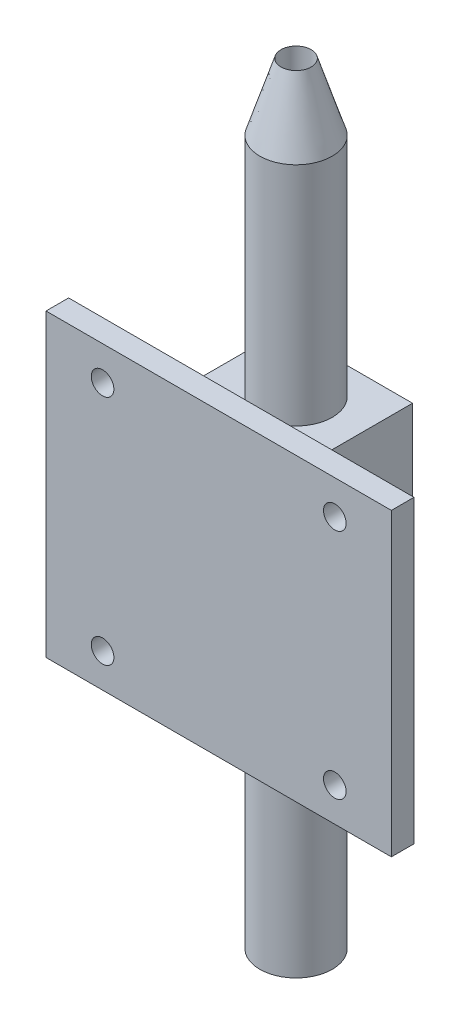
ISO-10303-21;
HEADER;
FILE_DESCRIPTION(('STEP AP214'),'2;1');
FILE_NAME('part.step','',(''),(''),'','','');
FILE_SCHEMA(('AUTOMOTIVE_DESIGN { 1 0 10303 214 1 1 1 1 }'));
ENDSEC;
DATA;
#1=APPLICATION_CONTEXT('core data for automotive mechanical design processes');
#2=APPLICATION_PROTOCOL_DEFINITION('international standard','automotive_design',2000,#1);
#3=PRODUCT_CONTEXT('',#1,'mechanical');
#4=PRODUCT('Part','Part','',(#3));
#5=PRODUCT_RELATED_PRODUCT_CATEGORY('part','',(#4));
#6=PRODUCT_DEFINITION_FORMATION('','',#4);
#7=PRODUCT_DEFINITION_CONTEXT('part definition',#1,'design');
#8=PRODUCT_DEFINITION('design','',#6,#7);
#9=PRODUCT_DEFINITION_SHAPE('','',#8);
#10=(LENGTH_UNIT() NAMED_UNIT(*) SI_UNIT(.MILLI.,.METRE.));
#11=(NAMED_UNIT(*) PLANE_ANGLE_UNIT() SI_UNIT($,.RADIAN.));
#12=(NAMED_UNIT(*) SI_UNIT($,.STERADIAN.) SOLID_ANGLE_UNIT());
#13=UNCERTAINTY_MEASURE_WITH_UNIT(LENGTH_MEASURE(1.E-05),#10,'distance_accuracy_value','');
#14=(GEOMETRIC_REPRESENTATION_CONTEXT(3) GLOBAL_UNCERTAINTY_ASSIGNED_CONTEXT((#13)) GLOBAL_UNIT_ASSIGNED_CONTEXT((#10,
#11,#12)) REPRESENTATION_CONTEXT('',''));
#15=CARTESIAN_POINT('',(0.,0.,0.));
#16=DIRECTION('',(0.,0.,1.));
#17=DIRECTION('',(1.,0.,0.));
#18=AXIS2_PLACEMENT_3D('',#15,#16,#17);
#19=CARTESIAN_POINT('',(0.,0.,0.));
#20=DIRECTION('',(0.,0.,-1.));
#21=DIRECTION('',(-1.,0.,0.));
#22=AXIS2_PLACEMENT_3D('',#19,#20,#21);
#23=PLANE('',#22);
#24=CARTESIAN_POINT('',(15.4,-15.4,0.));
#25=DIRECTION('',(0.,0.,1.));
#26=DIRECTION('',(1.,0.,0.));
#27=AXIS2_PLACEMENT_3D('',#24,#25,#26);
#28=CIRCLE('',#27,1.5);
#29=CARTESIAN_POINT('',(16.9,-15.4,0.));
#30=VERTEX_POINT('',#29);
#31=EDGE_CURVE('E139',#30,#30,#28,.T.);
#32=ORIENTED_EDGE('',*,*,#31,.T.);
#33=EDGE_LOOP('',(#32));
#34=FACE_BOUND('',#33,.T.);
#35=CARTESIAN_POINT('',(-15.4,15.4,0.));
#36=DIRECTION('',(0.,0.,1.));
#37=DIRECTION('',(1.,0.,0.));
#38=AXIS2_PLACEMENT_3D('',#35,#36,#37);
#39=CIRCLE('',#38,1.5);
#40=CARTESIAN_POINT('',(-13.9,15.4,0.));
#41=VERTEX_POINT('',#40);
#42=EDGE_CURVE('E151',#41,#41,#39,.T.);
#43=ORIENTED_EDGE('',*,*,#42,.T.);
#44=EDGE_LOOP('',(#43));
#45=FACE_BOUND('',#44,.T.);
#46=DIRECTION('',(1.,0.,0.));
#47=VECTOR('',#46,1.);
#48=CARTESIAN_POINT('',(-22.9,-19.9,0.));
#49=LINE('',#48,#47);
#50=CARTESIAN_POINT('',(-22.9,-19.9,0.));
#51=VERTEX_POINT('',#50);
#52=CARTESIAN_POINT('',(22.9,-19.9,0.));
#53=VERTEX_POINT('',#52);
#54=EDGE_CURVE('E157',#51,#53,#49,.T.);
#55=ORIENTED_EDGE('',*,*,#54,.F.);
#56=DIRECTION('',(0.,-1.,0.));
#57=VECTOR('',#56,1.);
#58=CARTESIAN_POINT('',(-22.9,19.9,0.));
#59=LINE('',#58,#57);
#60=CARTESIAN_POINT('',(-22.9,19.9,0.));
#61=VERTEX_POINT('',#60);
#62=EDGE_CURVE('E164',#61,#51,#59,.T.);
#63=ORIENTED_EDGE('',*,*,#62,.F.);
#64=DIRECTION('',(-1.,0.,0.));
#65=VECTOR('',#64,1.);
#66=CARTESIAN_POINT('',(-22.9,19.9,0.));
#67=LINE('',#66,#65);
#68=CARTESIAN_POINT('',(22.9,19.9,0.));
#69=VERTEX_POINT('',#68);
#70=EDGE_CURVE('E175',#69,#61,#67,.T.);
#71=ORIENTED_EDGE('',*,*,#70,.F.);
#72=DIRECTION('',(0.,1.,0.));
#73=VECTOR('',#72,1.);
#74=CARTESIAN_POINT('',(22.9,19.9,0.));
#75=LINE('',#74,#73);
#76=EDGE_CURVE('E173',#53,#69,#75,.T.);
#77=ORIENTED_EDGE('',*,*,#76,.F.);
#78=EDGE_LOOP('',(#55,#63,#71,#77));
#79=FACE_BOUND('',#78,.T.);
#80=CARTESIAN_POINT('',(15.4,15.4,0.));
#81=DIRECTION('',(0.,0.,1.));
#82=DIRECTION('',(1.,0.,0.));
#83=AXIS2_PLACEMENT_3D('',#80,#81,#82);
#84=CIRCLE('',#83,1.5);
#85=CARTESIAN_POINT('',(16.9,15.4,0.));
#86=VERTEX_POINT('',#85);
#87=EDGE_CURVE('E145',#86,#86,#84,.T.);
#88=ORIENTED_EDGE('',*,*,#87,.T.);
#89=EDGE_LOOP('',(#88));
#90=FACE_BOUND('',#89,.T.);
#91=CARTESIAN_POINT('',(-15.4,-15.4,0.));
#92=DIRECTION('',(0.,0.,1.));
#93=DIRECTION('',(1.,0.,0.));
#94=AXIS2_PLACEMENT_3D('',#91,#92,#93);
#95=CIRCLE('',#94,1.5);
#96=CARTESIAN_POINT('',(-13.9,-15.4,0.));
#97=VERTEX_POINT('',#96);
#98=EDGE_CURVE('E134',#97,#97,#95,.T.);
#99=ORIENTED_EDGE('',*,*,#98,.T.);
#100=EDGE_LOOP('',(#99));
#101=FACE_BOUND('',#100,.T.);
#102=DIRECTION('',(0.,1.,0.));
#103=VECTOR('',#102,1.);
#104=CARTESIAN_POINT('',(-8.5,0.,0.));
#105=LINE('',#104,#103);
#106=CARTESIAN_POINT('',(-8.5,-16.4,0.));
#107=VERTEX_POINT('',#106);
#108=CARTESIAN_POINT('',(-8.5,16.4,0.));
#109=VERTEX_POINT('',#108);
#110=EDGE_CURVE('E57',#107,#109,#105,.T.);
#111=ORIENTED_EDGE('',*,*,#110,.F.);
#112=DIRECTION('',(1.,0.,0.));
#113=VECTOR('',#112,1.);
#114=CARTESIAN_POINT('',(0.,-16.4,0.));
#115=LINE('',#114,#113);
#116=CARTESIAN_POINT('',(8.50000000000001,-16.4,0.));
#117=VERTEX_POINT('',#116);
#118=EDGE_CURVE('E11',#107,#117,#115,.T.);
#119=ORIENTED_EDGE('',*,*,#118,.T.);
#120=DIRECTION('',(0.,-1.,0.));
#121=VECTOR('',#120,1.);
#122=CARTESIAN_POINT('',(8.50000000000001,0.,0.));
#123=LINE('',#122,#121);
#124=CARTESIAN_POINT('',(8.50000000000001,16.4,0.));
#125=VERTEX_POINT('',#124);
#126=EDGE_CURVE('E47',#125,#117,#123,.T.);
#127=ORIENTED_EDGE('',*,*,#126,.F.);
#128=DIRECTION('',(1.,0.,0.));
#129=VECTOR('',#128,1.);
#130=CARTESIAN_POINT('',(0.,16.4,0.));
#131=LINE('',#130,#129);
#132=EDGE_CURVE('E108',#109,#125,#131,.T.);
#133=ORIENTED_EDGE('',*,*,#132,.F.);
#134=EDGE_LOOP('',(#111,#119,#127,#133));
#135=FACE_BOUND('',#134,.T.);
#136=ADVANCED_FACE('F39',(#34,#45,#79,#90,#101,#135),#23,.T.);
#137=CARTESIAN_POINT('',(0.,0.,3.));
#138=DIRECTION('',(0.,0.,-1.));
#139=DIRECTION('',(-1.,0.,0.));
#140=AXIS2_PLACEMENT_3D('',#137,#138,#139);
#141=PLANE('',#140);
#142=DIRECTION('',(1.,0.,0.));
#143=VECTOR('',#142,1.);
#144=CARTESIAN_POINT('',(-22.9,-19.9,3.));
#145=LINE('',#144,#143);
#146=CARTESIAN_POINT('',(-22.9,-19.9,3.));
#147=VERTEX_POINT('',#146);
#148=CARTESIAN_POINT('',(22.9,-19.9,3.));
#149=VERTEX_POINT('',#148);
#150=EDGE_CURVE('E160',#147,#149,#145,.T.);
#151=ORIENTED_EDGE('',*,*,#150,.T.);
#152=DIRECTION('',(0.,1.,0.));
#153=VECTOR('',#152,1.);
#154=CARTESIAN_POINT('',(22.9,19.9,3.));
#155=LINE('',#154,#153);
#156=CARTESIAN_POINT('',(22.9,19.9,3.));
#157=VERTEX_POINT('',#156);
#158=EDGE_CURVE('E163',#149,#157,#155,.T.);
#159=ORIENTED_EDGE('',*,*,#158,.T.);
#160=DIRECTION('',(-1.,0.,0.));
#161=VECTOR('',#160,1.);
#162=CARTESIAN_POINT('',(-22.9,19.9,3.));
#163=LINE('',#162,#161);
#164=CARTESIAN_POINT('',(-22.9,19.9,3.));
#165=VERTEX_POINT('',#164);
#166=EDGE_CURVE('E166',#157,#165,#163,.T.);
#167=ORIENTED_EDGE('',*,*,#166,.T.);
#168=DIRECTION('',(0.,-1.,0.));
#169=VECTOR('',#168,1.);
#170=CARTESIAN_POINT('',(-22.9,19.9,3.));
#171=LINE('',#170,#169);
#172=EDGE_CURVE('E168',#165,#147,#171,.T.);
#173=ORIENTED_EDGE('',*,*,#172,.T.);
#174=EDGE_LOOP('',(#151,#159,#167,#173));
#175=FACE_BOUND('',#174,.T.);
#176=CARTESIAN_POINT('',(-15.4,15.4,3.));
#177=DIRECTION('',(0.,0.,1.));
#178=DIRECTION('',(1.,0.,0.));
#179=AXIS2_PLACEMENT_3D('',#176,#177,#178);
#180=CIRCLE('',#179,1.5);
#181=CARTESIAN_POINT('',(-13.9,15.4,3.));
#182=VERTEX_POINT('',#181);
#183=EDGE_CURVE('E154',#182,#182,#180,.T.);
#184=ORIENTED_EDGE('',*,*,#183,.F.);
#185=EDGE_LOOP('',(#184));
#186=FACE_BOUND('',#185,.T.);
#187=CARTESIAN_POINT('',(15.4,15.4,3.));
#188=DIRECTION('',(0.,0.,1.));
#189=DIRECTION('',(1.,0.,0.));
#190=AXIS2_PLACEMENT_3D('',#187,#188,#189);
#191=CIRCLE('',#190,1.5);
#192=CARTESIAN_POINT('',(16.9,15.4,3.));
#193=VERTEX_POINT('',#192);
#194=EDGE_CURVE('E148',#193,#193,#191,.T.);
#195=ORIENTED_EDGE('',*,*,#194,.F.);
#196=EDGE_LOOP('',(#195));
#197=FACE_BOUND('',#196,.T.);
#198=CARTESIAN_POINT('',(15.4,-15.4,3.));
#199=DIRECTION('',(0.,0.,1.));
#200=DIRECTION('',(1.,0.,0.));
#201=AXIS2_PLACEMENT_3D('',#198,#199,#200);
#202=CIRCLE('',#201,1.5);
#203=CARTESIAN_POINT('',(16.9,-15.4,3.));
#204=VERTEX_POINT('',#203);
#205=EDGE_CURVE('E142',#204,#204,#202,.T.);
#206=ORIENTED_EDGE('',*,*,#205,.F.);
#207=EDGE_LOOP('',(#206));
#208=FACE_BOUND('',#207,.T.);
#209=CARTESIAN_POINT('',(-15.4,-15.4,3.));
#210=DIRECTION('',(0.,0.,1.));
#211=DIRECTION('',(1.,0.,0.));
#212=AXIS2_PLACEMENT_3D('',#209,#210,#211);
#213=CIRCLE('',#212,1.5);
#214=CARTESIAN_POINT('',(-13.9,-15.4,3.));
#215=VERTEX_POINT('',#214);
#216=EDGE_CURVE('E136',#215,#215,#213,.T.);
#217=ORIENTED_EDGE('',*,*,#216,.F.);
#218=EDGE_LOOP('',(#217));
#219=FACE_BOUND('',#218,.T.);
#220=ADVANCED_FACE('F206',(#175,#186,#197,#208,#219),#141,.F.);
#221=CARTESIAN_POINT('',(-22.9,-19.9,3.));
#222=DIRECTION('',(0.,1.,0.));
#223=DIRECTION('',(0.,0.,1.));
#224=AXIS2_PLACEMENT_3D('',#221,#222,#223);
#225=PLANE('',#224);
#226=ORIENTED_EDGE('',*,*,#54,.T.);
#227=DIRECTION('',(0.,0.,-1.));
#228=VECTOR('',#227,1.);
#229=CARTESIAN_POINT('',(22.9,-19.9,3.));
#230=LINE('',#229,#228);
#231=EDGE_CURVE('E186',#149,#53,#230,.T.);
#232=ORIENTED_EDGE('',*,*,#231,.F.);
#233=ORIENTED_EDGE('',*,*,#150,.F.);
#234=DIRECTION('',(0.,0.,-1.));
#235=VECTOR('',#234,1.);
#236=CARTESIAN_POINT('',(-22.9,-19.9,3.));
#237=LINE('',#236,#235);
#238=EDGE_CURVE('E170',#147,#51,#237,.T.);
#239=ORIENTED_EDGE('',*,*,#238,.T.);
#240=EDGE_LOOP('',(#226,#232,#233,#239));
#241=FACE_BOUND('',#240,.T.);
#242=ADVANCED_FACE('F41',(#241),#225,.F.);
#243=CARTESIAN_POINT('',(22.9,19.9,3.));
#244=DIRECTION('',(-1.,0.,0.));
#245=DIRECTION('',(0.,-1.,0.));
#246=AXIS2_PLACEMENT_3D('',#243,#244,#245);
#247=PLANE('',#246);
#248=ORIENTED_EDGE('',*,*,#76,.T.);
#249=DIRECTION('',(0.,0.,-1.));
#250=VECTOR('',#249,1.);
#251=CARTESIAN_POINT('',(22.9,19.9,3.));
#252=LINE('',#251,#250);
#253=EDGE_CURVE('E183',#157,#69,#252,.T.);
#254=ORIENTED_EDGE('',*,*,#253,.F.);
#255=ORIENTED_EDGE('',*,*,#158,.F.);
#256=ORIENTED_EDGE('',*,*,#231,.T.);
#257=EDGE_LOOP('',(#248,#254,#255,#256));
#258=FACE_BOUND('',#257,.T.);
#259=ADVANCED_FACE('F224',(#258),#247,.F.);
#260=CARTESIAN_POINT('',(-22.9,19.9,3.));
#261=DIRECTION('',(0.,-1.,0.));
#262=DIRECTION('',(0.,0.,-1.));
#263=AXIS2_PLACEMENT_3D('',#260,#261,#262);
#264=PLANE('',#263);
#265=ORIENTED_EDGE('',*,*,#70,.T.);
#266=DIRECTION('',(0.,0.,-1.));
#267=VECTOR('',#266,1.);
#268=CARTESIAN_POINT('',(-22.9,19.9,3.));
#269=LINE('',#268,#267);
#270=EDGE_CURVE('E180',#165,#61,#269,.T.);
#271=ORIENTED_EDGE('',*,*,#270,.F.);
#272=ORIENTED_EDGE('',*,*,#166,.F.);
#273=ORIENTED_EDGE('',*,*,#253,.T.);
#274=EDGE_LOOP('',(#265,#271,#272,#273));
#275=FACE_BOUND('',#274,.T.);
#276=ADVANCED_FACE('F221',(#275),#264,.F.);
#277=CARTESIAN_POINT('',(-22.9,19.9,3.));
#278=DIRECTION('',(1.,0.,0.));
#279=DIRECTION('',(0.,1.,0.));
#280=AXIS2_PLACEMENT_3D('',#277,#278,#279);
#281=PLANE('',#280);
#282=ORIENTED_EDGE('',*,*,#62,.T.);
#283=ORIENTED_EDGE('',*,*,#238,.F.);
#284=ORIENTED_EDGE('',*,*,#172,.F.);
#285=ORIENTED_EDGE('',*,*,#270,.T.);
#286=EDGE_LOOP('',(#282,#283,#284,#285));
#287=FACE_BOUND('',#286,.T.);
#288=ADVANCED_FACE('F217',(#287),#281,.F.);
#289=CARTESIAN_POINT('',(-15.4,15.4,3.));
#290=DIRECTION('',(0.,0.,-1.));
#291=DIRECTION('',(-1.,0.,0.));
#292=AXIS2_PLACEMENT_3D('',#289,#290,#291);
#293=CYLINDRICAL_SURFACE('',#292,1.5);
#294=ORIENTED_EDGE('',*,*,#183,.T.);
#295=EDGE_LOOP('',(#294));
#296=FACE_BOUND('',#295,.T.);
#297=ORIENTED_EDGE('',*,*,#42,.F.);
#298=EDGE_LOOP('',(#297));
#299=FACE_BOUND('',#298,.T.);
#300=ADVANCED_FACE('F220',(#296,#299),#293,.F.);
#301=CARTESIAN_POINT('',(15.4,15.4,3.));
#302=DIRECTION('',(0.,0.,-1.));
#303=DIRECTION('',(-1.,0.,0.));
#304=AXIS2_PLACEMENT_3D('',#301,#302,#303);
#305=CYLINDRICAL_SURFACE('',#304,1.5);
#306=ORIENTED_EDGE('',*,*,#194,.T.);
#307=EDGE_LOOP('',(#306));
#308=FACE_BOUND('',#307,.T.);
#309=ORIENTED_EDGE('',*,*,#87,.F.);
#310=EDGE_LOOP('',(#309));
#311=FACE_BOUND('',#310,.T.);
#312=ADVANCED_FACE('F262',(#308,#311),#305,.F.);
#313=CARTESIAN_POINT('',(15.4,-15.4,3.));
#314=DIRECTION('',(0.,0.,-1.));
#315=DIRECTION('',(-1.,0.,0.));
#316=AXIS2_PLACEMENT_3D('',#313,#314,#315);
#317=CYLINDRICAL_SURFACE('',#316,1.5);
#318=ORIENTED_EDGE('',*,*,#205,.T.);
#319=EDGE_LOOP('',(#318));
#320=FACE_BOUND('',#319,.T.);
#321=ORIENTED_EDGE('',*,*,#31,.F.);
#322=EDGE_LOOP('',(#321));
#323=FACE_BOUND('',#322,.T.);
#324=ADVANCED_FACE('F255',(#320,#323),#317,.F.);
#325=CARTESIAN_POINT('',(-15.4,-15.4,3.));
#326=DIRECTION('',(0.,0.,-1.));
#327=DIRECTION('',(-1.,0.,0.));
#328=AXIS2_PLACEMENT_3D('',#325,#326,#327);
#329=CYLINDRICAL_SURFACE('',#328,1.5);
#330=ORIENTED_EDGE('',*,*,#216,.T.);
#331=EDGE_LOOP('',(#330));
#332=FACE_BOUND('',#331,.T.);
#333=ORIENTED_EDGE('',*,*,#98,.F.);
#334=EDGE_LOOP('',(#333));
#335=FACE_BOUND('',#334,.T.);
#336=ADVANCED_FACE('F202',(#332,#335),#329,.F.);
#337=CARTESIAN_POINT('',(8.5,-16.4,-14.2097834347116));
#338=DIRECTION('',(1.,0.,0.));
#339=DIRECTION('',(0.,0.,-1.));
#340=AXIS2_PLACEMENT_3D('',#337,#338,#339);
#341=PLANE('',#340);
#342=DIRECTION('',(0.,0.,-1.));
#343=VECTOR('',#342,1.);
#344=CARTESIAN_POINT('',(8.5,16.4,-14.2097834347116));
#345=LINE('',#344,#343);
#346=CARTESIAN_POINT('',(8.5,16.4,-14.2097834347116));
#347=VERTEX_POINT('',#346);
#348=EDGE_CURVE('E101',#125,#347,#345,.T.);
#349=ORIENTED_EDGE('',*,*,#348,.F.);
#350=ORIENTED_EDGE('',*,*,#126,.T.);
#351=DIRECTION('',(0.,0.,-1.));
#352=VECTOR('',#351,1.);
#353=CARTESIAN_POINT('',(8.5,-16.4,-14.2097834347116));
#354=LINE('',#353,#352);
#355=CARTESIAN_POINT('',(8.5,-16.4,-14.2097834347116));
#356=VERTEX_POINT('',#355);
#357=EDGE_CURVE('E116',#117,#356,#354,.T.);
#358=ORIENTED_EDGE('',*,*,#357,.T.);
#359=DIRECTION('',(0.,1.,0.));
#360=VECTOR('',#359,1.);
#361=CARTESIAN_POINT('',(8.5,-16.4,-14.2097834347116));
#362=LINE('',#361,#360);
#363=EDGE_CURVE('E113',#356,#347,#362,.T.);
#364=ORIENTED_EDGE('',*,*,#363,.T.);
#365=EDGE_LOOP('',(#349,#350,#358,#364));
#366=FACE_BOUND('',#365,.T.);
#367=ADVANCED_FACE('F114',(#366),#341,.T.);
#368=CARTESIAN_POINT('',(-8.5,-16.4,-14.2097834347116));
#369=DIRECTION('',(-1.,0.,0.));
#370=DIRECTION('',(0.,0.,1.));
#371=AXIS2_PLACEMENT_3D('',#368,#369,#370);
#372=PLANE('',#371);
#373=DIRECTION('',(0.,0.,1.));
#374=VECTOR('',#373,1.);
#375=CARTESIAN_POINT('',(-8.5,-16.4,-14.2097834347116));
#376=LINE('',#375,#374);
#377=CARTESIAN_POINT('',(-8.5,-16.4,-14.2097834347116));
#378=VERTEX_POINT('',#377);
#379=EDGE_CURVE('E121',#378,#107,#376,.T.);
#380=ORIENTED_EDGE('',*,*,#379,.T.);
#381=ORIENTED_EDGE('',*,*,#110,.T.);
#382=DIRECTION('',(0.,0.,1.));
#383=VECTOR('',#382,1.);
#384=CARTESIAN_POINT('',(-8.5,16.4,-14.2097834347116));
#385=LINE('',#384,#383);
#386=CARTESIAN_POINT('',(-8.5,16.4,-14.2097834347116));
#387=VERTEX_POINT('',#386);
#388=EDGE_CURVE('E124',#387,#109,#385,.T.);
#389=ORIENTED_EDGE('',*,*,#388,.F.);
#390=DIRECTION('',(0.,1.,0.));
#391=VECTOR('',#390,1.);
#392=CARTESIAN_POINT('',(-8.5,-16.4,-14.2097834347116));
#393=LINE('',#392,#391);
#394=EDGE_CURVE('E120',#378,#387,#393,.T.);
#395=ORIENTED_EDGE('',*,*,#394,.F.);
#396=EDGE_LOOP('',(#380,#381,#389,#395));
#397=FACE_BOUND('',#396,.T.);
#398=ADVANCED_FACE('F194',(#397),#372,.T.);
#399=CARTESIAN_POINT('',(-8.5,-16.4,-14.2097834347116));
#400=DIRECTION('',(0.,0.,-1.));
#401=DIRECTION('',(-1.,0.,0.));
#402=AXIS2_PLACEMENT_3D('',#399,#400,#401);
#403=PLANE('',#402);
#404=ORIENTED_EDGE('',*,*,#394,.T.);
#405=DIRECTION('',(-1.,0.,0.));
#406=VECTOR('',#405,1.);
#407=CARTESIAN_POINT('',(-8.5,16.4,-14.2097834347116));
#408=LINE('',#407,#406);
#409=EDGE_CURVE('E106',#347,#387,#408,.T.);
#410=ORIENTED_EDGE('',*,*,#409,.F.);
#411=ORIENTED_EDGE('',*,*,#363,.F.);
#412=DIRECTION('',(-1.,0.,0.));
#413=VECTOR('',#412,1.);
#414=CARTESIAN_POINT('',(-8.5,-16.4,-14.2097834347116));
#415=LINE('',#414,#413);
#416=EDGE_CURVE('E130',#356,#378,#415,.T.);
#417=ORIENTED_EDGE('',*,*,#416,.T.);
#418=EDGE_LOOP('',(#404,#410,#411,#417));
#419=FACE_BOUND('',#418,.T.);
#420=ADVANCED_FACE('F123',(#419),#403,.T.);
#421=CARTESIAN_POINT('',(0.,-16.4,0.));
#422=DIRECTION('',(0.,1.,0.));
#423=DIRECTION('',(0.,0.,1.));
#424=AXIS2_PLACEMENT_3D('',#421,#422,#423);
#425=PLANE('',#424);
#426=CARTESIAN_POINT('',(0.,-16.4,-7.26125948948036));
#427=DIRECTION('',(0.,1.,0.));
#428=DIRECTION('',(0.,0.,1.));
#429=AXIS2_PLACEMENT_3D('',#426,#427,#428);
#430=CIRCLE('',#429,4.8);
#431=CARTESIAN_POINT('',(0.,-16.4,-2.46125948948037));
#432=VERTEX_POINT('',#431);
#433=EDGE_CURVE('E420',#432,#432,#430,.T.);
#434=ORIENTED_EDGE('',*,*,#433,.T.);
#435=EDGE_LOOP('',(#434));
#436=FACE_BOUND('',#435,.T.);
#437=ORIENTED_EDGE('',*,*,#118,.F.);
#438=ORIENTED_EDGE('',*,*,#379,.F.);
#439=ORIENTED_EDGE('',*,*,#416,.F.);
#440=ORIENTED_EDGE('',*,*,#357,.F.);
#441=EDGE_LOOP('',(#437,#438,#439,#440));
#442=FACE_BOUND('',#441,.T.);
#443=ADVANCED_FACE('F191',(#436,#442),#425,.F.);
#444=CARTESIAN_POINT('',(0.,16.4,0.));
#445=DIRECTION('',(0.,1.,0.));
#446=DIRECTION('',(0.,0.,1.));
#447=AXIS2_PLACEMENT_3D('',#444,#445,#446);
#448=PLANE('',#447);
#449=CARTESIAN_POINT('',(0.,16.4,-7.26125948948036));
#450=DIRECTION('',(0.,1.,0.));
#451=DIRECTION('',(0.,0.,1.));
#452=AXIS2_PLACEMENT_3D('',#449,#450,#451);
#453=CIRCLE('',#452,4.8);
#454=CARTESIAN_POINT('',(0.,16.4,-2.46125948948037));
#455=VERTEX_POINT('',#454);
#456=EDGE_CURVE('E110',#455,#455,#453,.T.);
#457=ORIENTED_EDGE('',*,*,#456,.F.);
#458=EDGE_LOOP('',(#457));
#459=FACE_BOUND('',#458,.T.);
#460=ORIENTED_EDGE('',*,*,#388,.T.);
#461=ORIENTED_EDGE('',*,*,#132,.T.);
#462=ORIENTED_EDGE('',*,*,#348,.T.);
#463=ORIENTED_EDGE('',*,*,#409,.T.);
#464=EDGE_LOOP('',(#460,#461,#462,#463));
#465=FACE_BOUND('',#464,.T.);
#466=ADVANCED_FACE('F104',(#459,#465),#448,.T.);
#467=CARTESIAN_POINT('',(0.,-47.,-7.26125948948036));
#468=DIRECTION('',(0.,1.,0.));
#469=DIRECTION('',(0.,0.,1.));
#470=AXIS2_PLACEMENT_3D('',#467,#468,#469);
#471=CYLINDRICAL_SURFACE('',#470,4.8);
#472=CARTESIAN_POINT('',(0.,-47.,-7.26125948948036));
#473=DIRECTION('',(0.,1.,0.));
#474=DIRECTION('',(0.,0.,1.));
#475=AXIS2_PLACEMENT_3D('',#472,#473,#474);
#476=CIRCLE('',#475,4.8);
#477=CARTESIAN_POINT('',(0.,-47.,-2.46125948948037));
#478=VERTEX_POINT('',#477);
#479=EDGE_CURVE('E417',#478,#478,#476,.T.);
#480=ORIENTED_EDGE('',*,*,#479,.T.);
#481=EDGE_LOOP('',(#480));
#482=FACE_BOUND('',#481,.T.);
#483=ORIENTED_EDGE('',*,*,#433,.F.);
#484=EDGE_LOOP('',(#483));
#485=FACE_BOUND('',#484,.T.);
#486=ADVANCED_FACE('F325',(#482,#485),#471,.T.);
#487=ORIENTED_EDGE('',*,*,#456,.T.);
#488=EDGE_LOOP('',(#487));
#489=FACE_BOUND('',#488,.T.);
#490=CARTESIAN_POINT('',(0.,46.4,-7.26125948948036));
#491=DIRECTION('',(0.,1.,0.));
#492=DIRECTION('',(0.,0.,1.));
#493=AXIS2_PLACEMENT_3D('',#490,#491,#492);
#494=CIRCLE('',#493,4.8);
#495=CARTESIAN_POINT('',(0.,46.4,-2.46125948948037));
#496=VERTEX_POINT('',#495);
#497=EDGE_CURVE('E408',#496,#496,#494,.T.);
#498=ORIENTED_EDGE('',*,*,#497,.F.);
#499=EDGE_LOOP('',(#498));
#500=FACE_BOUND('',#499,.T.);
#501=ADVANCED_FACE('F335',(#489,#500),#471,.T.);
#502=CARTESIAN_POINT('',(0.,-47.,-7.26125948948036));
#503=DIRECTION('',(0.,1.,0.));
#504=DIRECTION('',(0.,0.,1.));
#505=AXIS2_PLACEMENT_3D('',#502,#503,#504);
#506=PLANE('',#505);
#507=CARTESIAN_POINT('',(0.,-47.,-7.26125948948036));
#508=DIRECTION('',(0.,1.,0.));
#509=DIRECTION('',(0.,0.,1.));
#510=AXIS2_PLACEMENT_3D('',#507,#508,#509);
#511=CIRCLE('',#510,3.75);
#512=CARTESIAN_POINT('',(0.,-47.,-3.51125948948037));
#513=VERTEX_POINT('',#512);
#514=EDGE_CURVE('E414',#513,#513,#511,.T.);
#515=ORIENTED_EDGE('',*,*,#514,.T.);
#516=EDGE_LOOP('',(#515));
#517=FACE_BOUND('',#516,.T.);
#518=ORIENTED_EDGE('',*,*,#479,.F.);
#519=EDGE_LOOP('',(#518));
#520=FACE_BOUND('',#519,.T.);
#521=ADVANCED_FACE('F345',(#517,#520),#506,.F.);
#522=CARTESIAN_POINT('',(0.,-47.,-7.26125948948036));
#523=DIRECTION('',(0.,1.,0.));
#524=DIRECTION('',(0.,0.,1.));
#525=AXIS2_PLACEMENT_3D('',#522,#523,#524);
#526=CYLINDRICAL_SURFACE('',#525,3.75);
#527=ORIENTED_EDGE('',*,*,#514,.F.);
#528=EDGE_LOOP('',(#527));
#529=FACE_BOUND('',#528,.T.);
#530=CARTESIAN_POINT('',(0.,46.4,-7.26125948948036));
#531=DIRECTION('',(0.,1.,0.));
#532=DIRECTION('',(0.,0.,1.));
#533=AXIS2_PLACEMENT_3D('',#530,#531,#532);
#534=CIRCLE('',#533,3.75);
#535=CARTESIAN_POINT('',(0.,46.4,-3.51125948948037));
#536=VERTEX_POINT('',#535);
#537=EDGE_CURVE('E405',#536,#536,#534,.T.);
#538=ORIENTED_EDGE('',*,*,#537,.T.);
#539=EDGE_LOOP('',(#538));
#540=FACE_BOUND('',#539,.T.);
#541=ADVANCED_FACE('F354',(#529,#540),#526,.F.);
#542=CARTESIAN_POINT('',(0.,46.4,-2.46125948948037));
#543=DIRECTION('',(0.,1.,0.));
#544=DIRECTION('',(0.,0.,1.));
#545=AXIS2_PLACEMENT_3D('',#542,#543,#544);
#546=PLANE('',#545);
#547=CARTESIAN_POINT('',(0.,46.4,-7.26125948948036));
#548=DIRECTION('',(0.,1.,0.));
#549=DIRECTION('',(0.,0.,1.));
#550=AXIS2_PLACEMENT_3D('',#547,#548,#549);
#551=CIRCLE('',#550,2.);
#552=CARTESIAN_POINT('',(0.,46.4,-5.26125948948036));
#553=VERTEX_POINT('',#552);
#554=EDGE_CURVE('E404',#553,#553,#551,.T.);
#555=ORIENTED_EDGE('',*,*,#554,.T.);
#556=EDGE_LOOP('',(#555));
#557=FACE_BOUND('',#556,.T.);
#558=ORIENTED_EDGE('',*,*,#537,.F.);
#559=EDGE_LOOP('',(#558));
#560=FACE_BOUND('',#559,.T.);
#561=ADVANCED_FACE('F364',(#557,#560),#546,.F.);
#562=CARTESIAN_POINT('',(0.,55.2390422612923,-7.26125948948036));
#563=DIRECTION('',(0.,-1.,0.));
#564=DIRECTION('',(0.,0.,-1.));
#565=AXIS2_PLACEMENT_3D('',#562,#563,#564);
#566=CONICAL_SURFACE('',#565,2.,0.306776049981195);
#567=ORIENTED_EDGE('',*,*,#497,.T.);
#568=EDGE_LOOP('',(#567));
#569=FACE_BOUND('',#568,.T.);
#570=CARTESIAN_POINT('',(0.,55.2390422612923,-7.26125948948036));
#571=DIRECTION('',(0.,1.,0.));
#572=DIRECTION('',(0.,0.,1.));
#573=AXIS2_PLACEMENT_3D('',#570,#571,#572);
#574=CIRCLE('',#573,2.);
#575=CARTESIAN_POINT('',(0.,55.2390422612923,-5.26125948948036));
#576=VERTEX_POINT('',#575);
#577=EDGE_CURVE('E401',#576,#576,#574,.T.);
#578=ORIENTED_EDGE('',*,*,#577,.F.);
#579=EDGE_LOOP('',(#578));
#580=FACE_BOUND('',#579,.T.);
#581=ADVANCED_FACE('F372',(#569,#580),#566,.T.);
#582=CARTESIAN_POINT('',(0.,-47.,-7.26125948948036));
#583=DIRECTION('',(0.,1.,0.));
#584=DIRECTION('',(0.,0.,1.));
#585=AXIS2_PLACEMENT_3D('',#582,#583,#584);
#586=CYLINDRICAL_SURFACE('',#585,2.);
#587=ORIENTED_EDGE('',*,*,#577,.T.);
#588=EDGE_LOOP('',(#587));
#589=FACE_BOUND('',#588,.T.);
#590=ORIENTED_EDGE('',*,*,#554,.F.);
#591=EDGE_LOOP('',(#590));
#592=FACE_BOUND('',#591,.T.);
#593=ADVANCED_FACE('F377',(#589,#592),#586,.F.);
#594=CLOSED_SHELL('',(#136,#220,#242,#259,#276,#288,#300,#312,#324,#336,#367,#398,#420,#443,
#466,#486,#501,#521,#541,#561,#581,#593));
#595=MANIFOLD_SOLID_BREP('B2',#594);
#596=ADVANCED_BREP_SHAPE_REPRESENTATION('',(#18,#595),#14);
#597=SHAPE_DEFINITION_REPRESENTATION(#9,#596);
ENDSEC;
END-ISO-10303-21;
